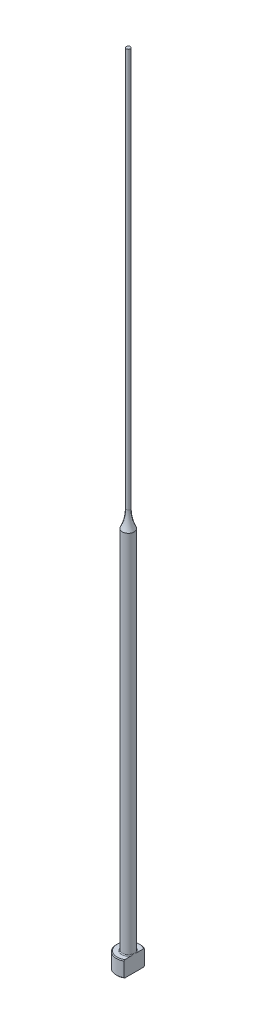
from build123d import *
from build123d.topology import SkipClean

# Parameters (mm, degrees)
CHAMFER1_SIZE    = 0.2
FILLET1_R        = 0.2
KEYED_HEAD_DEPTH = 201.044994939


with BuildPart() as part:
    # Sketch1 → Revolve1 (revolve)
    with BuildSketch(Plane.XY, mode=Mode.PRIVATE) as revolve1_sk:
        with BuildLine():
            Line((0, 0), (-3, 0))
            Line((-3, 0), (-3, 4))
            Line((-3, 4), (-1.5, 4))
            Line((-1.5, 4), (-1.5, 95.641101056))
            ThreePointArc((-1.5, 95.641101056), (-0.753205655, 97.763932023), (-0.5, 100))
            Line((-0.5, 100), (-0.5, 200))
            Line((-0.5, 200), (0, 200))
            Line((0, 200), (0, 0))
        make_face()
    revolve(revolve1_sk.sketch.rotate(Axis((0, 259.958771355, 0), (0, -1, 0)), 270), axis=Axis((0, 259.958771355, 0), (0, -1, 0)))

    # Chamfer1
    chamfer1_edges = [part.edges().sort_by_distance(p)[0] for p in [
        (0, 0, -3),
        (0, 4, -3),
    ]]
    chamfer(chamfer1_edges, length=CHAMFER1_SIZE)

    # Fillet1
    fillet1_edges = [part.edges().sort_by_distance(p)[0] for p in [
        (0, 4, -1.5),
    ]]
    fillet(fillet1_edges, radius=FILLET1_R)

    # Sketch2 → Keyed Head (cut, through all)
    with SkipClean():  # the faces are left unmerged after this step: merging them gives an invalid solid
        with BuildSketch(Plane(origin=(0, 0, 0), x_dir=(1, 0, 0), z_dir=(0, 1, 0))):
            with BuildLine():
                Line((1.5, -2.598076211), (1.5, 2.598076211))
                ThreePointArc((1.5, 2.598076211), (3, 0), (1.5, -2.598076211))
            make_face()
        extrude(amount=KEYED_HEAD_DEPTH, mode=Mode.SUBTRACT)


solid = part.part
